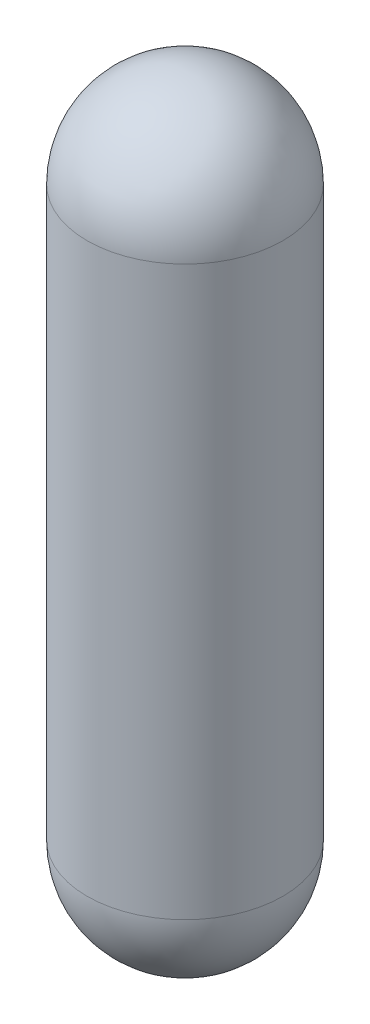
ISO-10303-21;
HEADER;
FILE_DESCRIPTION(('STEP AP214'),'2;1');
FILE_NAME('part.step','',(''),(''),'','','');
FILE_SCHEMA(('AUTOMOTIVE_DESIGN { 1 0 10303 214 1 1 1 1 }'));
ENDSEC;
DATA;
#1=APPLICATION_CONTEXT('core data for automotive mechanical design processes');
#2=APPLICATION_PROTOCOL_DEFINITION('international standard','automotive_design',2000,#1);
#3=PRODUCT_CONTEXT('',#1,'mechanical');
#4=PRODUCT('Part','Part','',(#3));
#5=PRODUCT_RELATED_PRODUCT_CATEGORY('part','',(#4));
#6=PRODUCT_DEFINITION_FORMATION('','',#4);
#7=PRODUCT_DEFINITION_CONTEXT('part definition',#1,'design');
#8=PRODUCT_DEFINITION('design','',#6,#7);
#9=PRODUCT_DEFINITION_SHAPE('','',#8);
#10=(LENGTH_UNIT() NAMED_UNIT(*) SI_UNIT(.MILLI.,.METRE.));
#11=(NAMED_UNIT(*) PLANE_ANGLE_UNIT() SI_UNIT($,.RADIAN.));
#12=(NAMED_UNIT(*) SI_UNIT($,.STERADIAN.) SOLID_ANGLE_UNIT());
#13=UNCERTAINTY_MEASURE_WITH_UNIT(LENGTH_MEASURE(1.E-05),#10,'distance_accuracy_value','');
#14=(GEOMETRIC_REPRESENTATION_CONTEXT(3) GLOBAL_UNCERTAINTY_ASSIGNED_CONTEXT((#13)) GLOBAL_UNIT_ASSIGNED_CONTEXT((#10,
#11,#12)) REPRESENTATION_CONTEXT('',''));
#15=CARTESIAN_POINT('',(0.,0.,0.));
#16=DIRECTION('',(0.,0.,1.));
#17=DIRECTION('',(1.,0.,0.));
#18=AXIS2_PLACEMENT_3D('',#15,#16,#17);
#19=CARTESIAN_POINT('',(-80.,-71.5,0.));
#20=DIRECTION('',(0.,-1.,0.));
#21=DIRECTION('',(0.,0.,-1.));
#22=AXIS2_PLACEMENT_3D('',#19,#20,#21);
#23=CYLINDRICAL_SURFACE('',#22,1.5);
#24=CARTESIAN_POINT('',(-80.,-80.2,0.));
#25=DIRECTION('',(0.,-1.,0.));
#26=DIRECTION('',(1.,0.,0.));
#27=AXIS2_PLACEMENT_3D('',#24,#25,#26);
#28=CIRCLE('',#27,1.5);
#29=CARTESIAN_POINT('',(-80.,-80.2,-1.5));
#30=VERTEX_POINT('',#29);
#31=CARTESIAN_POINT('',(-80.,-80.2,1.5));
#32=VERTEX_POINT('',#31);
#33=EDGE_CURVE('E11',#30,#32,#28,.T.);
#34=ORIENTED_EDGE('',*,*,#33,.F.);
#35=CARTESIAN_POINT('',(-80.,-80.2,0.));
#36=DIRECTION('',(0.,1.,0.));
#37=DIRECTION('',(-1.,0.,0.));
#38=AXIS2_PLACEMENT_3D('',#35,#36,#37);
#39=CIRCLE('',#38,1.5);
#40=EDGE_CURVE('E24',#30,#32,#39,.T.);
#41=ORIENTED_EDGE('',*,*,#40,.T.);
#42=EDGE_LOOP('',(#34,#41));
#43=FACE_BOUND('',#42,.T.);
#44=CARTESIAN_POINT('',(-80.,-71.5,0.));
#45=DIRECTION('',(0.,-1.,0.));
#46=DIRECTION('',(1.,0.,0.));
#47=AXIS2_PLACEMENT_3D('',#44,#45,#46);
#48=CIRCLE('',#47,1.5);
#49=CARTESIAN_POINT('',(-80.,-71.5,-1.5));
#50=VERTEX_POINT('',#49);
#51=CARTESIAN_POINT('',(-80.,-71.5,1.5));
#52=VERTEX_POINT('',#51);
#53=EDGE_CURVE('E41',#50,#52,#48,.T.);
#54=ORIENTED_EDGE('',*,*,#53,.T.);
#55=CARTESIAN_POINT('',(-80.,-71.5,0.));
#56=DIRECTION('',(0.,1.,0.));
#57=DIRECTION('',(-1.,0.,0.));
#58=AXIS2_PLACEMENT_3D('',#55,#56,#57);
#59=CIRCLE('',#58,1.5);
#60=EDGE_CURVE('E30',#50,#52,#59,.T.);
#61=ORIENTED_EDGE('',*,*,#60,.F.);
#62=EDGE_LOOP('',(#54,#61));
#63=FACE_BOUND('',#62,.T.);
#64=ADVANCED_FACE('F16',(#43,#63),#23,.T.);
#65=CARTESIAN_POINT('',(-80.,-80.2,0.));
#66=DIRECTION('',(0.,0.,1.));
#67=DIRECTION('',(1.,0.,0.));
#68=AXIS2_PLACEMENT_3D('',#65,#66,#67);
#69=SPHERICAL_SURFACE('',#68,1.5);
#70=CARTESIAN_POINT('',(-80.,-80.2,0.));
#71=DIRECTION('',(0.,-1.,0.));
#72=DIRECTION('',(1.,0.,0.));
#73=AXIS2_PLACEMENT_3D('',#70,#71,#72);
#74=SPHERICAL_SURFACE('',#73,1.5);
#75=ORIENTED_EDGE('',*,*,#33,.T.);
#76=ORIENTED_EDGE('',*,*,#40,.F.);
#77=EDGE_LOOP('',(#75,#76));
#78=FACE_BOUND('',#77,.T.);
#79=ADVANCED_FACE('F62',(#78),#74,.T.);
#80=CARTESIAN_POINT('',(-80.,-71.5,0.));
#81=DIRECTION('',(0.,0.,1.));
#82=DIRECTION('',(-1.,0.,0.));
#83=AXIS2_PLACEMENT_3D('',#80,#81,#82);
#84=SPHERICAL_SURFACE('',#83,1.5);
#85=CARTESIAN_POINT('',(-80.,-71.5,0.));
#86=DIRECTION('',(0.,1.,0.));
#87=DIRECTION('',(-1.,0.,0.));
#88=AXIS2_PLACEMENT_3D('',#85,#86,#87);
#89=SPHERICAL_SURFACE('',#88,1.5);
#90=ORIENTED_EDGE('',*,*,#60,.T.);
#91=ORIENTED_EDGE('',*,*,#53,.F.);
#92=EDGE_LOOP('',(#90,#91));
#93=FACE_BOUND('',#92,.T.);
#94=ADVANCED_FACE('F44',(#93),#89,.T.);
#95=CLOSED_SHELL('',(#64,#79,#94));
#96=MANIFOLD_SOLID_BREP('B1',#95);
#97=ADVANCED_BREP_SHAPE_REPRESENTATION('',(#18,#96),#14);
#98=SHAPE_DEFINITION_REPRESENTATION(#9,#97);
ENDSEC;
END-ISO-10303-21;
